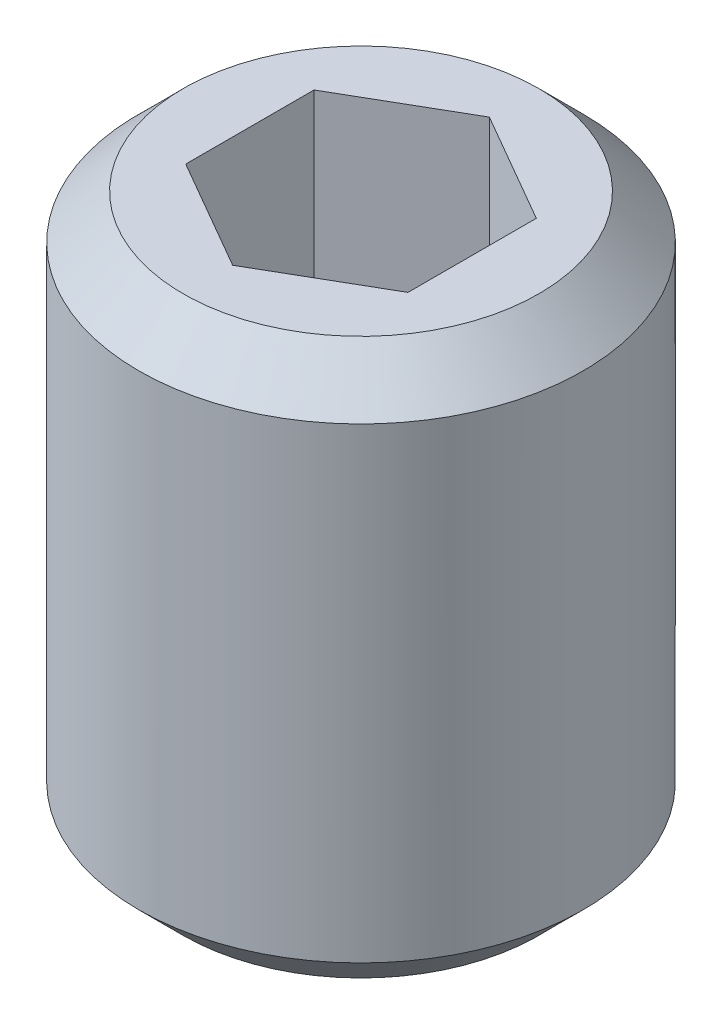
from build123d import *

# Parameters (mm, degrees)
ESQUISSE1_W             = 4
ESQUISSE1_H             = 10
CHANFREIN1_SIZE         = 0.8
CHANFREIN2_SIZE         = 0.8
ENL_V_MAT_EXTRU_1_DEPTH = 5


with BuildPart() as part:
    # Esquisse1 → Base-R_volution (revolve)
    with BuildSketch(Plane.XY, mode=Mode.PRIVATE) as base_r_volution_sk:
        with Locations((2, -5)):
            Rectangle(ESQUISSE1_W, ESQUISSE1_H)
    revolve(base_r_volution_sk.sketch.rotate(Axis((0, 0, 0), (0, -1, 0)), 90), axis=Axis((0, 0, 0), (0, -1, 0)))

    # Chanfrein1
    chanfrein1_edges = [part.edges().sort_by_distance(p)[0] for p in [
        (0, -10, -4),
    ]]
    chamfer(chanfrein1_edges, length=CHANFREIN1_SIZE)

    # Chanfrein2
    chanfrein2_edges = [part.edges().sort_by_distance(p)[0] for p in [
        (0, 0, -4),
    ]]
    chamfer(chanfrein2_edges, length=CHANFREIN2_SIZE)

    # Esquisse4 → Enl_v. mat.-Extru.1 (cut)
    with BuildSketch(Plane(origin=(0, 0, 0), x_dir=(-1, 0, 0), z_dir=(0, 1, 0))):
        Polygon((0, 2.309401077), (-2, 1.154700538), (-2, -1.154700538), (0, -2.309401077), (2, -1.154700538), (2, 1.154700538), align=None)
    extrude(amount=-ENL_V_MAT_EXTRU_1_DEPTH, mode=Mode.SUBTRACT)


solid = part.part
